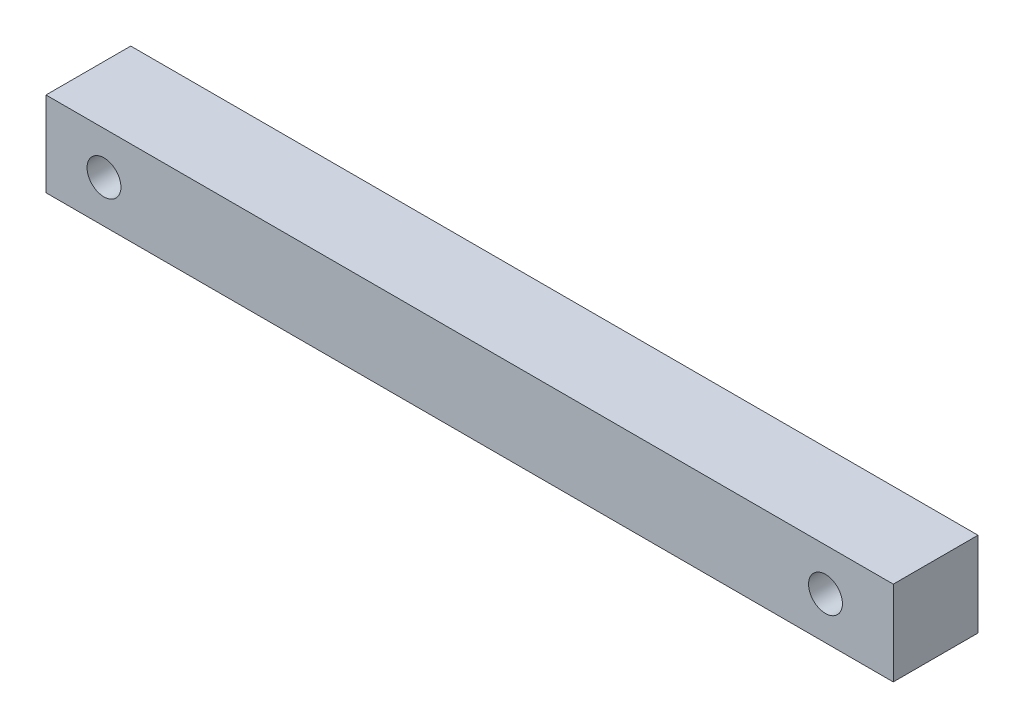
ISO-10303-21;
HEADER;
FILE_DESCRIPTION(('STEP AP214'),'2;1');
FILE_NAME('part.step','',(''),(''),'','','');
FILE_SCHEMA(('AUTOMOTIVE_DESIGN { 1 0 10303 214 1 1 1 1 }'));
ENDSEC;
DATA;
#1=APPLICATION_CONTEXT('core data for automotive mechanical design processes');
#2=APPLICATION_PROTOCOL_DEFINITION('international standard','automotive_design',2000,#1);
#3=PRODUCT_CONTEXT('',#1,'mechanical');
#4=PRODUCT('Part','Part','',(#3));
#5=PRODUCT_RELATED_PRODUCT_CATEGORY('part','',(#4));
#6=PRODUCT_DEFINITION_FORMATION('','',#4);
#7=PRODUCT_DEFINITION_CONTEXT('part definition',#1,'design');
#8=PRODUCT_DEFINITION('design','',#6,#7);
#9=PRODUCT_DEFINITION_SHAPE('','',#8);
#10=(LENGTH_UNIT() NAMED_UNIT(*) SI_UNIT(.MILLI.,.METRE.));
#11=(NAMED_UNIT(*) PLANE_ANGLE_UNIT() SI_UNIT($,.RADIAN.));
#12=(NAMED_UNIT(*) SI_UNIT($,.STERADIAN.) SOLID_ANGLE_UNIT());
#13=UNCERTAINTY_MEASURE_WITH_UNIT(LENGTH_MEASURE(1.E-05),#10,'distance_accuracy_value','');
#14=(GEOMETRIC_REPRESENTATION_CONTEXT(3) GLOBAL_UNCERTAINTY_ASSIGNED_CONTEXT((#13)) GLOBAL_UNIT_ASSIGNED_CONTEXT((#10,
#11,#12)) REPRESENTATION_CONTEXT('',''));
#15=CARTESIAN_POINT('',(0.,0.,0.));
#16=DIRECTION('',(0.,0.,1.));
#17=DIRECTION('',(1.,0.,0.));
#18=AXIS2_PLACEMENT_3D('',#15,#16,#17);
#19=CARTESIAN_POINT('',(-25.,2.5,5.));
#20=DIRECTION('',(1.,0.,0.));
#21=DIRECTION('',(0.,0.,-1.));
#22=AXIS2_PLACEMENT_3D('',#19,#20,#21);
#23=PLANE('',#22);
#24=DIRECTION('',(0.,-1.,0.));
#25=VECTOR('',#24,1.);
#26=CARTESIAN_POINT('',(-25.,2.5,0.));
#27=LINE('',#26,#25);
#28=CARTESIAN_POINT('',(-25.,2.5,0.));
#29=VERTEX_POINT('',#28);
#30=CARTESIAN_POINT('',(-25.,-2.5,0.));
#31=VERTEX_POINT('',#30);
#32=EDGE_CURVE('E96',#29,#31,#27,.T.);
#33=ORIENTED_EDGE('',*,*,#32,.T.);
#34=DIRECTION('',(0.,0.,-1.));
#35=VECTOR('',#34,1.);
#36=CARTESIAN_POINT('',(-25.,-2.5,5.));
#37=LINE('',#36,#35);
#38=CARTESIAN_POINT('',(-25.,-2.5,5.));
#39=VERTEX_POINT('',#38);
#40=EDGE_CURVE('E11',#39,#31,#37,.T.);
#41=ORIENTED_EDGE('',*,*,#40,.F.);
#42=DIRECTION('',(0.,-1.,0.));
#43=VECTOR('',#42,1.);
#44=CARTESIAN_POINT('',(-25.,2.5,5.));
#45=LINE('',#44,#43);
#46=CARTESIAN_POINT('',(-25.,2.5,5.));
#47=VERTEX_POINT('',#46);
#48=EDGE_CURVE('E84',#47,#39,#45,.T.);
#49=ORIENTED_EDGE('',*,*,#48,.F.);
#50=DIRECTION('',(0.,0.,-1.));
#51=VECTOR('',#50,1.);
#52=CARTESIAN_POINT('',(-25.,2.5,5.));
#53=LINE('',#52,#51);
#54=EDGE_CURVE('E92',#47,#29,#53,.T.);
#55=ORIENTED_EDGE('',*,*,#54,.T.);
#56=EDGE_LOOP('',(#33,#41,#49,#55));
#57=FACE_BOUND('',#56,.T.);
#58=ADVANCED_FACE('F33',(#57),#23,.F.);
#59=CARTESIAN_POINT('',(-25.,-2.5,5.));
#60=DIRECTION('',(0.,1.,0.));
#61=DIRECTION('',(0.,0.,1.));
#62=AXIS2_PLACEMENT_3D('',#59,#60,#61);
#63=PLANE('',#62);
#64=DIRECTION('',(1.,0.,0.));
#65=VECTOR('',#64,1.);
#66=CARTESIAN_POINT('',(-25.,-2.5,0.));
#67=LINE('',#66,#65);
#68=CARTESIAN_POINT('',(25.,-2.5,0.));
#69=VERTEX_POINT('',#68);
#70=EDGE_CURVE('E88',#31,#69,#67,.T.);
#71=ORIENTED_EDGE('',*,*,#70,.T.);
#72=DIRECTION('',(0.,0.,-1.));
#73=VECTOR('',#72,1.);
#74=CARTESIAN_POINT('',(25.,-2.5,5.));
#75=LINE('',#74,#73);
#76=CARTESIAN_POINT('',(25.,-2.5,5.));
#77=VERTEX_POINT('',#76);
#78=EDGE_CURVE('E41',#77,#69,#75,.T.);
#79=ORIENTED_EDGE('',*,*,#78,.F.);
#80=DIRECTION('',(1.,0.,0.));
#81=VECTOR('',#80,1.);
#82=CARTESIAN_POINT('',(-25.,-2.5,5.));
#83=LINE('',#82,#81);
#84=EDGE_CURVE('E79',#39,#77,#83,.T.);
#85=ORIENTED_EDGE('',*,*,#84,.F.);
#86=ORIENTED_EDGE('',*,*,#40,.T.);
#87=EDGE_LOOP('',(#71,#79,#85,#86));
#88=FACE_BOUND('',#87,.T.);
#89=ADVANCED_FACE('F87',(#88),#63,.F.);
#90=CARTESIAN_POINT('',(25.,2.5,5.));
#91=DIRECTION('',(-1.,0.,0.));
#92=DIRECTION('',(0.,0.,1.));
#93=AXIS2_PLACEMENT_3D('',#90,#91,#92);
#94=PLANE('',#93);
#95=DIRECTION('',(0.,1.,0.));
#96=VECTOR('',#95,1.);
#97=CARTESIAN_POINT('',(25.,2.5,0.));
#98=LINE('',#97,#96);
#99=CARTESIAN_POINT('',(25.,2.5,0.));
#100=VERTEX_POINT('',#99);
#101=EDGE_CURVE('E66',#69,#100,#98,.T.);
#102=ORIENTED_EDGE('',*,*,#101,.T.);
#103=DIRECTION('',(0.,0.,-1.));
#104=VECTOR('',#103,1.);
#105=CARTESIAN_POINT('',(25.,2.5,5.));
#106=LINE('',#105,#104);
#107=CARTESIAN_POINT('',(25.,2.5,5.));
#108=VERTEX_POINT('',#107);
#109=EDGE_CURVE('E89',#108,#100,#106,.T.);
#110=ORIENTED_EDGE('',*,*,#109,.F.);
#111=DIRECTION('',(0.,1.,0.));
#112=VECTOR('',#111,1.);
#113=CARTESIAN_POINT('',(25.,2.5,5.));
#114=LINE('',#113,#112);
#115=EDGE_CURVE('E82',#77,#108,#114,.T.);
#116=ORIENTED_EDGE('',*,*,#115,.F.);
#117=ORIENTED_EDGE('',*,*,#78,.T.);
#118=EDGE_LOOP('',(#102,#110,#116,#117));
#119=FACE_BOUND('',#118,.T.);
#120=ADVANCED_FACE('F90',(#119),#94,.F.);
#121=CARTESIAN_POINT('',(-25.,2.5,5.));
#122=DIRECTION('',(0.,-1.,0.));
#123=DIRECTION('',(0.,0.,-1.));
#124=AXIS2_PLACEMENT_3D('',#121,#122,#123);
#125=PLANE('',#124);
#126=DIRECTION('',(-1.,0.,0.));
#127=VECTOR('',#126,1.);
#128=CARTESIAN_POINT('',(-25.,2.5,0.));
#129=LINE('',#128,#127);
#130=EDGE_CURVE('E72',#100,#29,#129,.T.);
#131=ORIENTED_EDGE('',*,*,#130,.T.);
#132=ORIENTED_EDGE('',*,*,#54,.F.);
#133=DIRECTION('',(-1.,0.,0.));
#134=VECTOR('',#133,1.);
#135=CARTESIAN_POINT('',(-25.,2.5,5.));
#136=LINE('',#135,#134);
#137=EDGE_CURVE('E49',#108,#47,#136,.T.);
#138=ORIENTED_EDGE('',*,*,#137,.F.);
#139=ORIENTED_EDGE('',*,*,#109,.T.);
#140=EDGE_LOOP('',(#131,#132,#138,#139));
#141=FACE_BOUND('',#140,.T.);
#142=ADVANCED_FACE('F104',(#141),#125,.F.);
#143=CARTESIAN_POINT('',(0.,0.,5.));
#144=DIRECTION('',(0.,0.,1.));
#145=DIRECTION('',(1.,0.,0.));
#146=AXIS2_PLACEMENT_3D('',#143,#144,#145);
#147=PLANE('',#146);
#148=CARTESIAN_POINT('',(21.,0.,5.));
#149=DIRECTION('',(0.,0.,1.));
#150=DIRECTION('',(1.,0.,0.));
#151=AXIS2_PLACEMENT_3D('',#148,#149,#150);
#152=CIRCLE('',#151,0.999999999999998);
#153=CARTESIAN_POINT('',(22.,0.,5.));
#154=VERTEX_POINT('',#153);
#155=EDGE_CURVE('E116',#154,#154,#152,.T.);
#156=ORIENTED_EDGE('',*,*,#155,.F.);
#157=EDGE_LOOP('',(#156));
#158=FACE_BOUND('',#157,.T.);
#159=CARTESIAN_POINT('',(-21.578,0.,5.));
#160=DIRECTION('',(0.,0.,1.));
#161=DIRECTION('',(1.,0.,0.));
#162=AXIS2_PLACEMENT_3D('',#159,#160,#161);
#163=CIRCLE('',#162,1.);
#164=CARTESIAN_POINT('',(-20.578,0.,5.));
#165=VERTEX_POINT('',#164);
#166=EDGE_CURVE('E110',#165,#165,#163,.T.);
#167=ORIENTED_EDGE('',*,*,#166,.F.);
#168=EDGE_LOOP('',(#167));
#169=FACE_BOUND('',#168,.T.);
#170=ORIENTED_EDGE('',*,*,#48,.T.);
#171=ORIENTED_EDGE('',*,*,#84,.T.);
#172=ORIENTED_EDGE('',*,*,#115,.T.);
#173=ORIENTED_EDGE('',*,*,#137,.T.);
#174=EDGE_LOOP('',(#170,#171,#172,#173));
#175=FACE_BOUND('',#174,.T.);
#176=ADVANCED_FACE('F80',(#158,#169,#175),#147,.T.);
#177=CARTESIAN_POINT('',(0.,0.,0.));
#178=DIRECTION('',(0.,0.,1.));
#179=DIRECTION('',(1.,0.,0.));
#180=AXIS2_PLACEMENT_3D('',#177,#178,#179);
#181=PLANE('',#180);
#182=CARTESIAN_POINT('',(21.,0.,0.));
#183=DIRECTION('',(0.,0.,1.));
#184=DIRECTION('',(1.,0.,0.));
#185=AXIS2_PLACEMENT_3D('',#182,#183,#184);
#186=CIRCLE('',#185,0.999999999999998);
#187=CARTESIAN_POINT('',(22.,0.,0.));
#188=VERTEX_POINT('',#187);
#189=EDGE_CURVE('E113',#188,#188,#186,.T.);
#190=ORIENTED_EDGE('',*,*,#189,.T.);
#191=EDGE_LOOP('',(#190));
#192=FACE_BOUND('',#191,.T.);
#193=CARTESIAN_POINT('',(-21.578,0.,0.));
#194=DIRECTION('',(0.,0.,1.));
#195=DIRECTION('',(1.,0.,0.));
#196=AXIS2_PLACEMENT_3D('',#193,#194,#195);
#197=CIRCLE('',#196,1.);
#198=CARTESIAN_POINT('',(-20.578,0.,0.));
#199=VERTEX_POINT('',#198);
#200=EDGE_CURVE('E99',#199,#199,#197,.T.);
#201=ORIENTED_EDGE('',*,*,#200,.T.);
#202=EDGE_LOOP('',(#201));
#203=FACE_BOUND('',#202,.T.);
#204=ORIENTED_EDGE('',*,*,#32,.F.);
#205=ORIENTED_EDGE('',*,*,#130,.F.);
#206=ORIENTED_EDGE('',*,*,#101,.F.);
#207=ORIENTED_EDGE('',*,*,#70,.F.);
#208=EDGE_LOOP('',(#204,#205,#206,#207));
#209=FACE_BOUND('',#208,.T.);
#210=ADVANCED_FACE('F107',(#192,#203,#209),#181,.F.);
#211=CARTESIAN_POINT('',(-21.578,0.,0.));
#212=DIRECTION('',(0.,0.,1.));
#213=DIRECTION('',(1.,0.,0.));
#214=AXIS2_PLACEMENT_3D('',#211,#212,#213);
#215=CYLINDRICAL_SURFACE('',#214,1.);
#216=ORIENTED_EDGE('',*,*,#200,.F.);
#217=EDGE_LOOP('',(#216));
#218=FACE_BOUND('',#217,.T.);
#219=ORIENTED_EDGE('',*,*,#166,.T.);
#220=EDGE_LOOP('',(#219));
#221=FACE_BOUND('',#220,.T.);
#222=ADVANCED_FACE('F127',(#218,#221),#215,.F.);
#223=CARTESIAN_POINT('',(21.,0.,0.));
#224=DIRECTION('',(0.,0.,1.));
#225=DIRECTION('',(1.,0.,0.));
#226=AXIS2_PLACEMENT_3D('',#223,#224,#225);
#227=CYLINDRICAL_SURFACE('',#226,0.999999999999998);
#228=ORIENTED_EDGE('',*,*,#189,.F.);
#229=EDGE_LOOP('',(#228));
#230=FACE_BOUND('',#229,.T.);
#231=ORIENTED_EDGE('',*,*,#155,.T.);
#232=EDGE_LOOP('',(#231));
#233=FACE_BOUND('',#232,.T.);
#234=ADVANCED_FACE('F124',(#230,#233),#227,.F.);
#235=CLOSED_SHELL('',(#58,#89,#120,#142,#176,#210,#222,#234));
#236=MANIFOLD_SOLID_BREP('B2',#235);
#237=ADVANCED_BREP_SHAPE_REPRESENTATION('',(#18,#236),#14);
#238=SHAPE_DEFINITION_REPRESENTATION(#9,#237);
ENDSEC;
END-ISO-10303-21;
